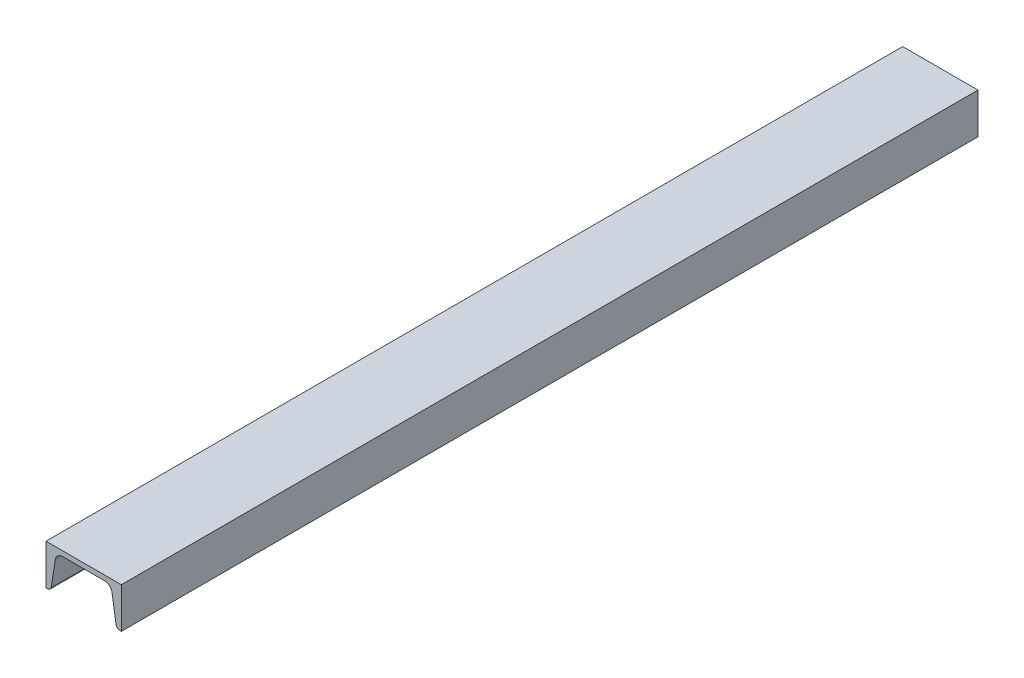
from build123d import *

# Parameters (mm, degrees)
EXTRUDE_1_DEPTH = 910


with BuildPart() as part:
    # Sketch 1 → Extrude 1 (new body)
    with BuildSketch(Plane.XY):
        with BuildLine():
            Line((-40, 0), (40, 0))
            Line((40, 0), (40, -43))
            Line((40, -43), (38.417975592, -43))
            ThreePointArc((38.417975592, -43), (35.819456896, -42.041003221), (34.466923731, -39.623850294))
            Line((34.466923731, -39.623850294), (30.11352096, -12.052299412))
            ThreePointArc((30.11352096, -12.052299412), (27.408454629, -7.217993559), (22.211417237, -5.3))
            Line((22.211417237, -5.3), (-22.211417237, -5.3))
            ThreePointArc((-22.211417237, -5.3), (-27.408454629, -7.217993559), (-30.11352096, -12.052299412))
            Line((-30.11352096, -12.052299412), (-34.466923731, -39.623850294))
            ThreePointArc((-34.466923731, -39.623850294), (-35.819456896, -42.041003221), (-38.417975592, -43))
            Line((-38.417975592, -43), (-40, -43))
            Line((-40, -43), (-40, 0))
        make_face()
    extrude(amount=EXTRUDE_1_DEPTH)


solid = part.part
